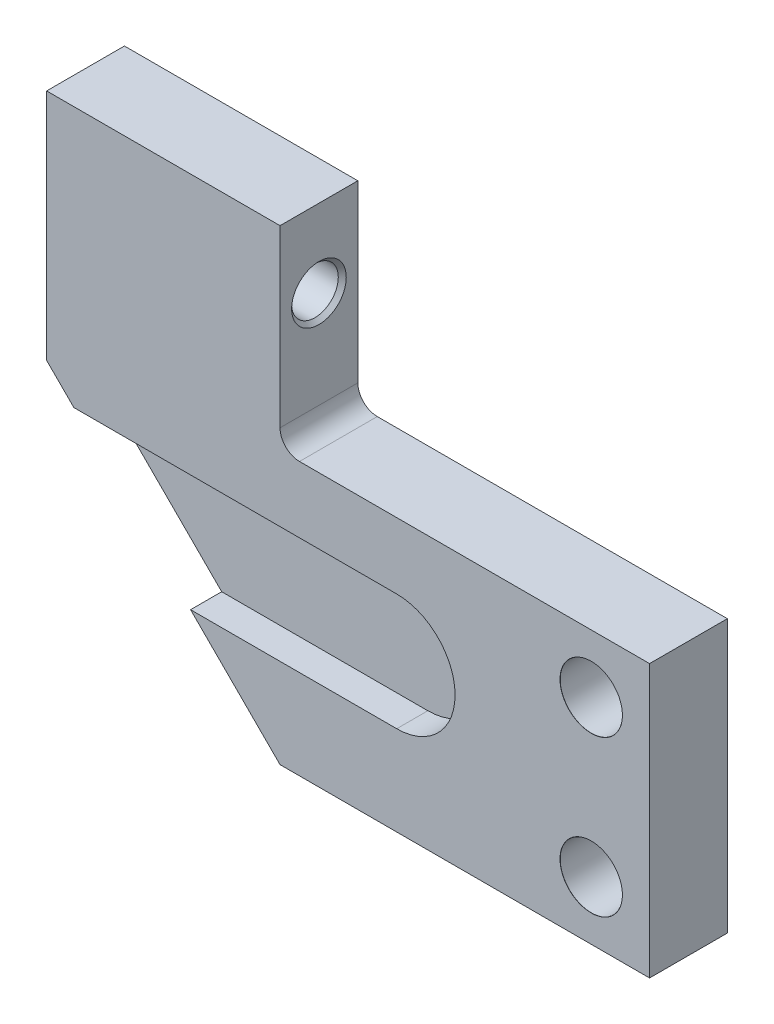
ISO-10303-21;
HEADER;
FILE_DESCRIPTION(('STEP AP214'),'2;1');
FILE_NAME('part.step','',(''),(''),'','','');
FILE_SCHEMA(('AUTOMOTIVE_DESIGN { 1 0 10303 214 1 1 1 1 }'));
ENDSEC;
DATA;
#1=APPLICATION_CONTEXT('core data for automotive mechanical design processes');
#2=APPLICATION_PROTOCOL_DEFINITION('international standard','automotive_design',2000,#1);
#3=PRODUCT_CONTEXT('',#1,'mechanical');
#4=PRODUCT('Part','Part','',(#3));
#5=PRODUCT_RELATED_PRODUCT_CATEGORY('part','',(#4));
#6=PRODUCT_DEFINITION_FORMATION('','',#4);
#7=PRODUCT_DEFINITION_CONTEXT('part definition',#1,'design');
#8=PRODUCT_DEFINITION('design','',#6,#7);
#9=PRODUCT_DEFINITION_SHAPE('','',#8);
#10=(LENGTH_UNIT() NAMED_UNIT(*) SI_UNIT(.MILLI.,.METRE.));
#11=(NAMED_UNIT(*) PLANE_ANGLE_UNIT() SI_UNIT($,.RADIAN.));
#12=(NAMED_UNIT(*) SI_UNIT($,.STERADIAN.) SOLID_ANGLE_UNIT());
#13=UNCERTAINTY_MEASURE_WITH_UNIT(LENGTH_MEASURE(1.E-05),#10,'distance_accuracy_value','');
#14=(GEOMETRIC_REPRESENTATION_CONTEXT(3) GLOBAL_UNCERTAINTY_ASSIGNED_CONTEXT((#13)) GLOBAL_UNIT_ASSIGNED_CONTEXT((#10,
#11,#12)) REPRESENTATION_CONTEXT('',''));
#15=CARTESIAN_POINT('',(0.,0.,0.));
#16=DIRECTION('',(0.,0.,1.));
#17=DIRECTION('',(1.,0.,0.));
#18=AXIS2_PLACEMENT_3D('',#15,#16,#17);
#19=CARTESIAN_POINT('',(77.5,70.,20.));
#20=DIRECTION('',(0.,-1.,0.));
#21=DIRECTION('',(0.,0.,-1.));
#22=AXIS2_PLACEMENT_3D('',#19,#20,#21);
#23=PLANE('',#22);
#24=DIRECTION('',(-1.,0.,0.));
#25=VECTOR('',#24,1.);
#26=CARTESIAN_POINT('',(77.5,70.,0.));
#27=LINE('',#26,#25);
#28=CARTESIAN_POINT('',(155.,70.,0.));
#29=VERTEX_POINT('',#28);
#30=CARTESIAN_POINT('',(65.,70.,0.));
#31=VERTEX_POINT('',#30);
#32=EDGE_CURVE('E148',#29,#31,#27,.T.);
#33=ORIENTED_EDGE('',*,*,#32,.T.);
#34=DIRECTION('',(0.,0.,-1.));
#35=VECTOR('',#34,1.);
#36=CARTESIAN_POINT('',(65.,70.,20.));
#37=LINE('',#36,#35);
#38=CARTESIAN_POINT('',(65.,70.,20.));
#39=VERTEX_POINT('',#38);
#40=EDGE_CURVE('E11',#39,#31,#37,.T.);
#41=ORIENTED_EDGE('',*,*,#40,.F.);
#42=DIRECTION('',(-1.,0.,0.));
#43=VECTOR('',#42,1.);
#44=CARTESIAN_POINT('',(77.5,70.,20.));
#45=LINE('',#44,#43);
#46=CARTESIAN_POINT('',(155.,70.,20.));
#47=VERTEX_POINT('',#46);
#48=EDGE_CURVE('E168',#47,#39,#45,.T.);
#49=ORIENTED_EDGE('',*,*,#48,.F.);
#50=DIRECTION('',(0.,0.,-1.));
#51=VECTOR('',#50,1.);
#52=CARTESIAN_POINT('',(155.,70.,20.));
#53=LINE('',#52,#51);
#54=EDGE_CURVE('E143',#47,#29,#53,.T.);
#55=ORIENTED_EDGE('',*,*,#54,.T.);
#56=EDGE_LOOP('',(#33,#41,#49,#55));
#57=FACE_BOUND('',#56,.T.);
#58=ADVANCED_FACE('F37',(#57),#23,.F.);
#59=CARTESIAN_POINT('',(65.,75.,20.));
#60=DIRECTION('',(0.,0.,-1.));
#61=DIRECTION('',(-1.,0.,0.));
#62=AXIS2_PLACEMENT_3D('',#59,#60,#61);
#63=CYLINDRICAL_SURFACE('',#62,5.);
#64=CARTESIAN_POINT('',(65.,75.,0.));
#65=DIRECTION('',(0.,0.,1.));
#66=DIRECTION('',(1.,0.,0.));
#67=AXIS2_PLACEMENT_3D('',#64,#65,#66);
#68=CIRCLE('',#67,5.);
#69=CARTESIAN_POINT('',(60.,75.,0.));
#70=VERTEX_POINT('',#69);
#71=EDGE_CURVE('E151',#31,#70,#68,.F.);
#72=ORIENTED_EDGE('',*,*,#71,.T.);
#73=DIRECTION('',(0.,0.,-1.));
#74=VECTOR('',#73,1.);
#75=CARTESIAN_POINT('',(60.,75.,20.));
#76=LINE('',#75,#74);
#77=CARTESIAN_POINT('',(60.,75.,20.));
#78=VERTEX_POINT('',#77);
#79=EDGE_CURVE('E44',#78,#70,#76,.T.);
#80=ORIENTED_EDGE('',*,*,#79,.F.);
#81=CARTESIAN_POINT('',(65.,75.,20.));
#82=DIRECTION('',(0.,0.,1.));
#83=DIRECTION('',(1.,0.,0.));
#84=AXIS2_PLACEMENT_3D('',#81,#82,#83);
#85=CIRCLE('',#84,5.);
#86=EDGE_CURVE('E101',#39,#78,#85,.F.);
#87=ORIENTED_EDGE('',*,*,#86,.F.);
#88=ORIENTED_EDGE('',*,*,#40,.T.);
#89=EDGE_LOOP('',(#72,#80,#87,#88));
#90=FACE_BOUND('',#89,.T.);
#91=ADVANCED_FACE('F181',(#90),#63,.F.);
#92=CARTESIAN_POINT('',(60.,-92.6115003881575,20.));
#93=DIRECTION('',(1.,0.,0.));
#94=DIRECTION('',(0.,0.,-1.));
#95=AXIS2_PLACEMENT_3D('',#92,#93,#94);
#96=PLANE('',#95);
#97=CARTESIAN_POINT('',(60.,100.,9.99999999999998));
#98=DIRECTION('',(1.,0.,0.));
#99=DIRECTION('',(0.,0.,-1.));
#100=AXIS2_PLACEMENT_3D('',#97,#98,#99);
#101=CIRCLE('',#100,7.025);
#102=CARTESIAN_POINT('',(60.,100.,2.97499999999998));
#103=VERTEX_POINT('',#102);
#104=EDGE_CURVE('E423',#103,#103,#101,.T.);
#105=ORIENTED_EDGE('',*,*,#104,.F.);
#106=EDGE_LOOP('',(#105));
#107=FACE_BOUND('',#106,.T.);
#108=DIRECTION('',(0.,-1.,0.));
#109=VECTOR('',#108,1.);
#110=CARTESIAN_POINT('',(60.,-92.6115003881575,0.));
#111=LINE('',#110,#109);
#112=CARTESIAN_POINT('',(60.,120.,0.));
#113=VERTEX_POINT('',#112);
#114=EDGE_CURVE('E155',#113,#70,#111,.T.);
#115=ORIENTED_EDGE('',*,*,#114,.F.);
#116=DIRECTION('',(0.,0.,-1.));
#117=VECTOR('',#116,1.);
#118=CARTESIAN_POINT('',(60.,120.,20.));
#119=LINE('',#118,#117);
#120=CARTESIAN_POINT('',(60.,120.,20.));
#121=VERTEX_POINT('',#120);
#122=EDGE_CURVE('E174',#121,#113,#119,.T.);
#123=ORIENTED_EDGE('',*,*,#122,.F.);
#124=DIRECTION('',(0.,-1.,0.));
#125=VECTOR('',#124,1.);
#126=CARTESIAN_POINT('',(60.,-92.6115003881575,20.));
#127=LINE('',#126,#125);
#128=EDGE_CURVE('E180',#121,#78,#127,.T.);
#129=ORIENTED_EDGE('',*,*,#128,.T.);
#130=ORIENTED_EDGE('',*,*,#79,.T.);
#131=EDGE_LOOP('',(#115,#123,#129,#130));
#132=FACE_BOUND('',#131,.T.);
#133=ADVANCED_FACE('F178',(#107,#132),#96,.T.);
#134=CARTESIAN_POINT('',(77.5,120.,20.));
#135=DIRECTION('',(0.,1.,0.));
#136=DIRECTION('',(0.,0.,1.));
#137=AXIS2_PLACEMENT_3D('',#134,#135,#136);
#138=PLANE('',#137);
#139=DIRECTION('',(1.,0.,0.));
#140=VECTOR('',#139,1.);
#141=CARTESIAN_POINT('',(77.5,120.,0.));
#142=LINE('',#141,#140);
#143=CARTESIAN_POINT('',(0.,120.,0.));
#144=VERTEX_POINT('',#143);
#145=EDGE_CURVE('E158',#144,#113,#142,.T.);
#146=ORIENTED_EDGE('',*,*,#145,.F.);
#147=DIRECTION('',(0.,0.,-1.));
#148=VECTOR('',#147,1.);
#149=CARTESIAN_POINT('',(0.,120.,20.));
#150=LINE('',#149,#148);
#151=CARTESIAN_POINT('',(0.,120.,20.));
#152=VERTEX_POINT('',#151);
#153=EDGE_CURVE('E172',#152,#144,#150,.T.);
#154=ORIENTED_EDGE('',*,*,#153,.F.);
#155=DIRECTION('',(1.,0.,0.));
#156=VECTOR('',#155,1.);
#157=CARTESIAN_POINT('',(77.5,120.,20.));
#158=LINE('',#157,#156);
#159=EDGE_CURVE('E192',#152,#121,#158,.T.);
#160=ORIENTED_EDGE('',*,*,#159,.T.);
#161=ORIENTED_EDGE('',*,*,#122,.T.);
#162=EDGE_LOOP('',(#146,#154,#160,#161));
#163=FACE_BOUND('',#162,.T.);
#164=ADVANCED_FACE('F189',(#163),#138,.T.);
#165=CARTESIAN_POINT('',(0.,-92.6115003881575,20.));
#166=DIRECTION('',(-1.,0.,0.));
#167=DIRECTION('',(0.,0.,1.));
#168=AXIS2_PLACEMENT_3D('',#165,#166,#167);
#169=PLANE('',#168);
#170=CARTESIAN_POINT('',(0.,100.,9.99999999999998));
#171=DIRECTION('',(1.,0.,0.));
#172=DIRECTION('',(0.,0.,-1.));
#173=AXIS2_PLACEMENT_3D('',#170,#171,#172);
#174=CIRCLE('',#173,7.02499999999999);
#175=CARTESIAN_POINT('',(0.,100.,2.97499999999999));
#176=VERTEX_POINT('',#175);
#177=EDGE_CURVE('E424',#176,#176,#174,.T.);
#178=ORIENTED_EDGE('',*,*,#177,.T.);
#179=EDGE_LOOP('',(#178));
#180=FACE_BOUND('',#179,.T.);
#181=DIRECTION('',(0.,1.,0.));
#182=VECTOR('',#181,1.);
#183=CARTESIAN_POINT('',(0.,-92.6115003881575,0.));
#184=LINE('',#183,#182);
#185=CARTESIAN_POINT('',(0.,60.,0.));
#186=VERTEX_POINT('',#185);
#187=EDGE_CURVE('E161',#186,#144,#184,.T.);
#188=ORIENTED_EDGE('',*,*,#187,.F.);
#189=DIRECTION('',(0.,0.,-1.));
#190=VECTOR('',#189,1.);
#191=CARTESIAN_POINT('',(0.,60.,20.));
#192=LINE('',#191,#190);
#193=CARTESIAN_POINT('',(0.,60.,20.));
#194=VERTEX_POINT('',#193);
#195=EDGE_CURVE('E138',#194,#186,#192,.T.);
#196=ORIENTED_EDGE('',*,*,#195,.F.);
#197=DIRECTION('',(0.,1.,0.));
#198=VECTOR('',#197,1.);
#199=CARTESIAN_POINT('',(0.,-92.6115003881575,20.));
#200=LINE('',#199,#198);
#201=EDGE_CURVE('E128',#194,#152,#200,.T.);
#202=ORIENTED_EDGE('',*,*,#201,.T.);
#203=ORIENTED_EDGE('',*,*,#153,.T.);
#204=EDGE_LOOP('',(#188,#196,#202,#203));
#205=FACE_BOUND('',#204,.T.);
#206=ADVANCED_FACE('F200',(#180,#205),#169,.T.);
#207=CARTESIAN_POINT('',(115.055750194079,-55.0557501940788,20.));
#208=DIRECTION('',(0.707106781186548,0.707106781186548,0.));
#209=DIRECTION('',(-0.707106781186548,0.707106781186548,0.));
#210=AXIS2_PLACEMENT_3D('',#207,#208,#209);
#211=PLANE('',#210);
#212=DIRECTION('',(0.707106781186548,-0.707106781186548,0.));
#213=VECTOR('',#212,1.);
#214=CARTESIAN_POINT('',(6.99999999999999,53.,12.));
#215=LINE('',#214,#213);
#216=CARTESIAN_POINT('',(6.99999999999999,53.,12.));
#217=VERTEX_POINT('',#216);
#218=CARTESIAN_POINT('',(37.,23.,12.));
#219=VERTEX_POINT('',#218);
#220=EDGE_CURVE('E209',#217,#219,#215,.T.);
#221=ORIENTED_EDGE('',*,*,#220,.F.);
#222=DIRECTION('',(0.,0.,1.));
#223=VECTOR('',#222,1.);
#224=CARTESIAN_POINT('',(6.99999999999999,53.,12.));
#225=LINE('',#224,#223);
#226=CARTESIAN_POINT('',(6.99999999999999,53.,20.));
#227=VERTEX_POINT('',#226);
#228=EDGE_CURVE('E152',#217,#227,#225,.T.);
#229=ORIENTED_EDGE('',*,*,#228,.T.);
#230=DIRECTION('',(0.707106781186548,-0.707106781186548,0.));
#231=VECTOR('',#230,1.);
#232=CARTESIAN_POINT('',(115.055750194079,-55.0557501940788,20.));
#233=LINE('',#232,#231);
#234=EDGE_CURVE('E127',#194,#227,#233,.T.);
#235=ORIENTED_EDGE('',*,*,#234,.F.);
#236=ORIENTED_EDGE('',*,*,#195,.T.);
#237=DIRECTION('',(0.707106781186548,-0.707106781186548,0.));
#238=VECTOR('',#237,1.);
#239=CARTESIAN_POINT('',(115.055750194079,-55.0557501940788,0.));
#240=LINE('',#239,#238);
#241=CARTESIAN_POINT('',(60.,0.,0.));
#242=VERTEX_POINT('',#241);
#243=EDGE_CURVE('E135',#186,#242,#240,.T.);
#244=ORIENTED_EDGE('',*,*,#243,.T.);
#245=DIRECTION('',(0.,0.,-1.));
#246=VECTOR('',#245,1.);
#247=CARTESIAN_POINT('',(60.,0.,20.));
#248=LINE('',#247,#246);
#249=CARTESIAN_POINT('',(60.,0.,20.));
#250=VERTEX_POINT('',#249);
#251=EDGE_CURVE('E131',#250,#242,#248,.T.);
#252=ORIENTED_EDGE('',*,*,#251,.F.);
#253=CARTESIAN_POINT('',(37.,23.,20.));
#254=VERTEX_POINT('',#253);
#255=EDGE_CURVE('E117',#254,#250,#233,.T.);
#256=ORIENTED_EDGE('',*,*,#255,.F.);
#257=DIRECTION('',(0.,0.,1.));
#258=VECTOR('',#257,1.);
#259=CARTESIAN_POINT('',(37.,23.,12.));
#260=LINE('',#259,#258);
#261=EDGE_CURVE('E51',#219,#254,#260,.T.);
#262=ORIENTED_EDGE('',*,*,#261,.F.);
#263=EDGE_LOOP('',(#221,#229,#235,#236,#244,#252,#256,#262));
#264=FACE_BOUND('',#263,.T.);
#265=ADVANCED_FACE('F133',(#264),#211,.F.);
#266=CARTESIAN_POINT('',(77.5,0.,20.));
#267=DIRECTION('',(0.,1.,0.));
#268=DIRECTION('',(0.,0.,1.));
#269=AXIS2_PLACEMENT_3D('',#266,#267,#268);
#270=PLANE('',#269);
#271=DIRECTION('',(1.,0.,0.));
#272=VECTOR('',#271,1.);
#273=CARTESIAN_POINT('',(77.5,0.,0.));
#274=LINE('',#273,#272);
#275=CARTESIAN_POINT('',(155.,0.,0.));
#276=VERTEX_POINT('',#275);
#277=EDGE_CURVE('E165',#242,#276,#274,.T.);
#278=ORIENTED_EDGE('',*,*,#277,.T.);
#279=DIRECTION('',(0.,0.,-1.));
#280=VECTOR('',#279,1.);
#281=CARTESIAN_POINT('',(155.,0.,20.));
#282=LINE('',#281,#280);
#283=CARTESIAN_POINT('',(155.,0.,20.));
#284=VERTEX_POINT('',#283);
#285=EDGE_CURVE('E139',#284,#276,#282,.T.);
#286=ORIENTED_EDGE('',*,*,#285,.F.);
#287=DIRECTION('',(1.,0.,0.));
#288=VECTOR('',#287,1.);
#289=CARTESIAN_POINT('',(77.5,0.,20.));
#290=LINE('',#289,#288);
#291=EDGE_CURVE('E122',#250,#284,#290,.T.);
#292=ORIENTED_EDGE('',*,*,#291,.F.);
#293=ORIENTED_EDGE('',*,*,#251,.T.);
#294=EDGE_LOOP('',(#278,#286,#292,#293));
#295=FACE_BOUND('',#294,.T.);
#296=ADVANCED_FACE('F141',(#295),#270,.F.);
#297=CARTESIAN_POINT('',(155.,-92.6115003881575,20.));
#298=DIRECTION('',(-1.,0.,0.));
#299=DIRECTION('',(0.,0.,1.));
#300=AXIS2_PLACEMENT_3D('',#297,#298,#299);
#301=PLANE('',#300);
#302=DIRECTION('',(0.,1.,0.));
#303=VECTOR('',#302,1.);
#304=CARTESIAN_POINT('',(155.,-92.6115003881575,0.));
#305=LINE('',#304,#303);
#306=EDGE_CURVE('E93',#276,#29,#305,.T.);
#307=ORIENTED_EDGE('',*,*,#306,.T.);
#308=ORIENTED_EDGE('',*,*,#54,.F.);
#309=DIRECTION('',(0.,1.,0.));
#310=VECTOR('',#309,1.);
#311=CARTESIAN_POINT('',(155.,-92.6115003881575,20.));
#312=LINE('',#311,#310);
#313=EDGE_CURVE('E60',#284,#47,#312,.T.);
#314=ORIENTED_EDGE('',*,*,#313,.F.);
#315=ORIENTED_EDGE('',*,*,#285,.T.);
#316=EDGE_LOOP('',(#307,#308,#314,#315));
#317=FACE_BOUND('',#316,.T.);
#318=ADVANCED_FACE('F226',(#317),#301,.F.);
#319=CARTESIAN_POINT('',(77.5,-92.6115003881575,20.));
#320=DIRECTION('',(0.,0.,1.));
#321=DIRECTION('',(1.,0.,0.));
#322=AXIS2_PLACEMENT_3D('',#319,#320,#321);
#323=PLANE('',#322);
#324=CARTESIAN_POINT('',(140.,55.,20.));
#325=DIRECTION('',(0.,0.,1.));
#326=DIRECTION('',(1.,0.,0.));
#327=AXIS2_PLACEMENT_3D('',#324,#325,#326);
#328=CIRCLE('',#327,8.025);
#329=CARTESIAN_POINT('',(148.025,55.,20.));
#330=VERTEX_POINT('',#329);
#331=EDGE_CURVE('E436',#330,#330,#328,.T.);
#332=ORIENTED_EDGE('',*,*,#331,.F.);
#333=EDGE_LOOP('',(#332));
#334=FACE_BOUND('',#333,.T.);
#335=CARTESIAN_POINT('',(140.,15.,20.));
#336=DIRECTION('',(0.,0.,1.));
#337=DIRECTION('',(1.,0.,0.));
#338=AXIS2_PLACEMENT_3D('',#335,#336,#337);
#339=CIRCLE('',#338,8.025);
#340=CARTESIAN_POINT('',(148.025,15.,20.));
#341=VERTEX_POINT('',#340);
#342=EDGE_CURVE('E448',#341,#341,#339,.T.);
#343=ORIENTED_EDGE('',*,*,#342,.F.);
#344=EDGE_LOOP('',(#343));
#345=FACE_BOUND('',#344,.T.);
#346=DIRECTION('',(-1.,0.,0.));
#347=VECTOR('',#346,1.);
#348=CARTESIAN_POINT('',(6.99999999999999,53.,20.));
#349=LINE('',#348,#347);
#350=CARTESIAN_POINT('',(90.,53.,20.));
#351=VERTEX_POINT('',#350);
#352=EDGE_CURVE('E204',#351,#227,#349,.T.);
#353=ORIENTED_EDGE('',*,*,#352,.F.);
#354=CARTESIAN_POINT('',(90.,38.,20.));
#355=DIRECTION('',(0.,0.,1.));
#356=DIRECTION('',(-1.,0.,0.));
#357=AXIS2_PLACEMENT_3D('',#354,#355,#356);
#358=CIRCLE('',#357,15.);
#359=CARTESIAN_POINT('',(90.,23.,20.));
#360=VERTEX_POINT('',#359);
#361=EDGE_CURVE('E465',#360,#351,#358,.T.);
#362=ORIENTED_EDGE('',*,*,#361,.F.);
#363=DIRECTION('',(1.,0.,0.));
#364=VECTOR('',#363,1.);
#365=CARTESIAN_POINT('',(90.,23.,20.));
#366=LINE('',#365,#364);
#367=EDGE_CURVE('E125',#254,#360,#366,.T.);
#368=ORIENTED_EDGE('',*,*,#367,.F.);
#369=ORIENTED_EDGE('',*,*,#255,.T.);
#370=ORIENTED_EDGE('',*,*,#291,.T.);
#371=ORIENTED_EDGE('',*,*,#313,.T.);
#372=ORIENTED_EDGE('',*,*,#48,.T.);
#373=ORIENTED_EDGE('',*,*,#86,.T.);
#374=ORIENTED_EDGE('',*,*,#128,.F.);
#375=ORIENTED_EDGE('',*,*,#159,.F.);
#376=ORIENTED_EDGE('',*,*,#201,.F.);
#377=ORIENTED_EDGE('',*,*,#234,.T.);
#378=EDGE_LOOP('',(#353,#362,#368,#369,#370,#371,#372,#373,#374,#375,#376,#377));
#379=FACE_BOUND('',#378,.T.);
#380=ADVANCED_FACE('F120',(#334,#345,#379),#323,.T.);
#381=CARTESIAN_POINT('',(77.5,-92.6115003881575,0.));
#382=DIRECTION('',(0.,0.,1.));
#383=DIRECTION('',(1.,0.,0.));
#384=AXIS2_PLACEMENT_3D('',#381,#382,#383);
#385=PLANE('',#384);
#386=CARTESIAN_POINT('',(140.,55.,0.));
#387=DIRECTION('',(0.,0.,1.));
#388=DIRECTION('',(1.,0.,0.));
#389=AXIS2_PLACEMENT_3D('',#386,#387,#388);
#390=CIRCLE('',#389,8.025);
#391=CARTESIAN_POINT('',(148.025,55.,0.));
#392=VERTEX_POINT('',#391);
#393=EDGE_CURVE('E433',#392,#392,#390,.T.);
#394=ORIENTED_EDGE('',*,*,#393,.T.);
#395=EDGE_LOOP('',(#394));
#396=FACE_BOUND('',#395,.T.);
#397=CARTESIAN_POINT('',(140.,15.,0.));
#398=DIRECTION('',(0.,0.,1.));
#399=DIRECTION('',(1.,0.,0.));
#400=AXIS2_PLACEMENT_3D('',#397,#398,#399);
#401=CIRCLE('',#400,8.025);
#402=CARTESIAN_POINT('',(148.025,15.,0.));
#403=VERTEX_POINT('',#402);
#404=EDGE_CURVE('E445',#403,#403,#401,.T.);
#405=ORIENTED_EDGE('',*,*,#404,.T.);
#406=EDGE_LOOP('',(#405));
#407=FACE_BOUND('',#406,.T.);
#408=ORIENTED_EDGE('',*,*,#32,.F.);
#409=ORIENTED_EDGE('',*,*,#306,.F.);
#410=ORIENTED_EDGE('',*,*,#277,.F.);
#411=ORIENTED_EDGE('',*,*,#243,.F.);
#412=ORIENTED_EDGE('',*,*,#187,.T.);
#413=ORIENTED_EDGE('',*,*,#145,.T.);
#414=ORIENTED_EDGE('',*,*,#114,.T.);
#415=ORIENTED_EDGE('',*,*,#71,.F.);
#416=EDGE_LOOP('',(#408,#409,#410,#411,#412,#413,#414,#415));
#417=FACE_BOUND('',#416,.T.);
#418=ADVANCED_FACE('F185',(#396,#407,#417),#385,.F.);
#419=CARTESIAN_POINT('',(6.99999999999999,53.,12.));
#420=DIRECTION('',(0.,1.,0.));
#421=DIRECTION('',(-1.,0.,0.));
#422=AXIS2_PLACEMENT_3D('',#419,#420,#421);
#423=PLANE('',#422);
#424=ORIENTED_EDGE('',*,*,#352,.T.);
#425=ORIENTED_EDGE('',*,*,#228,.F.);
#426=DIRECTION('',(-1.,0.,0.));
#427=VECTOR('',#426,1.);
#428=CARTESIAN_POINT('',(6.99999999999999,53.,12.));
#429=LINE('',#428,#427);
#430=CARTESIAN_POINT('',(90.,53.,12.));
#431=VERTEX_POINT('',#430);
#432=EDGE_CURVE('E223',#431,#217,#429,.T.);
#433=ORIENTED_EDGE('',*,*,#432,.F.);
#434=DIRECTION('',(0.,0.,1.));
#435=VECTOR('',#434,1.);
#436=CARTESIAN_POINT('',(90.,53.,12.));
#437=LINE('',#436,#435);
#438=EDGE_CURVE('E213',#431,#351,#437,.T.);
#439=ORIENTED_EDGE('',*,*,#438,.T.);
#440=EDGE_LOOP('',(#424,#425,#433,#439));
#441=FACE_BOUND('',#440,.T.);
#442=ADVANCED_FACE('F285',(#441),#423,.F.);
#443=CARTESIAN_POINT('',(90.,38.,12.));
#444=DIRECTION('',(0.,0.,1.));
#445=DIRECTION('',(1.,0.,0.));
#446=AXIS2_PLACEMENT_3D('',#443,#444,#445);
#447=CYLINDRICAL_SURFACE('',#446,15.);
#448=ORIENTED_EDGE('',*,*,#361,.T.);
#449=ORIENTED_EDGE('',*,*,#438,.F.);
#450=CARTESIAN_POINT('',(90.,38.,12.));
#451=DIRECTION('',(0.,0.,1.));
#452=DIRECTION('',(-1.,0.,0.));
#453=AXIS2_PLACEMENT_3D('',#450,#451,#452);
#454=CIRCLE('',#453,15.);
#455=CARTESIAN_POINT('',(90.,23.,12.));
#456=VERTEX_POINT('',#455);
#457=EDGE_CURVE('E461',#456,#431,#454,.T.);
#458=ORIENTED_EDGE('',*,*,#457,.F.);
#459=DIRECTION('',(0.,0.,1.));
#460=VECTOR('',#459,1.);
#461=CARTESIAN_POINT('',(90.,23.,12.));
#462=LINE('',#461,#460);
#463=EDGE_CURVE('E216',#456,#360,#462,.T.);
#464=ORIENTED_EDGE('',*,*,#463,.T.);
#465=EDGE_LOOP('',(#448,#449,#458,#464));
#466=FACE_BOUND('',#465,.T.);
#467=ADVANCED_FACE('F293',(#466),#447,.F.);
#468=CARTESIAN_POINT('',(90.,23.,12.));
#469=DIRECTION('',(0.,-1.,0.));
#470=DIRECTION('',(1.,0.,0.));
#471=AXIS2_PLACEMENT_3D('',#468,#469,#470);
#472=PLANE('',#471);
#473=ORIENTED_EDGE('',*,*,#367,.T.);
#474=ORIENTED_EDGE('',*,*,#463,.F.);
#475=DIRECTION('',(1.,0.,0.));
#476=VECTOR('',#475,1.);
#477=CARTESIAN_POINT('',(90.,23.,12.));
#478=LINE('',#477,#476);
#479=EDGE_CURVE('E458',#219,#456,#478,.T.);
#480=ORIENTED_EDGE('',*,*,#479,.F.);
#481=ORIENTED_EDGE('',*,*,#261,.T.);
#482=EDGE_LOOP('',(#473,#474,#480,#481));
#483=FACE_BOUND('',#482,.T.);
#484=ADVANCED_FACE('F301',(#483),#472,.F.);
#485=CARTESIAN_POINT('',(90.,38.,12.));
#486=DIRECTION('',(0.,0.,-1.));
#487=DIRECTION('',(-1.,0.,0.));
#488=AXIS2_PLACEMENT_3D('',#485,#486,#487);
#489=PLANE('',#488);
#490=ORIENTED_EDGE('',*,*,#220,.T.);
#491=ORIENTED_EDGE('',*,*,#479,.T.);
#492=ORIENTED_EDGE('',*,*,#457,.T.);
#493=ORIENTED_EDGE('',*,*,#432,.T.);
#494=EDGE_LOOP('',(#490,#491,#492,#493));
#495=FACE_BOUND('',#494,.T.);
#496=ADVANCED_FACE('F310',(#495),#489,.F.);
#497=CARTESIAN_POINT('',(140.,15.,0.0249999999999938));
#498=DIRECTION('',(0.,0.,-1.));
#499=DIRECTION('',(-1.,0.,0.));
#500=AXIS2_PLACEMENT_3D('',#497,#498,#499);
#501=CONICAL_SURFACE('',#500,8.00000000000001,0.785398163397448);
#502=ORIENTED_EDGE('',*,*,#404,.F.);
#503=EDGE_LOOP('',(#502));
#504=FACE_BOUND('',#503,.T.);
#505=CARTESIAN_POINT('',(140.,15.,0.0249999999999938));
#506=DIRECTION('',(0.,0.,1.));
#507=DIRECTION('',(1.,0.,0.));
#508=AXIS2_PLACEMENT_3D('',#505,#506,#507);
#509=CIRCLE('',#508,8.00000000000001);
#510=CARTESIAN_POINT('',(148.,15.,0.0249999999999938));
#511=VERTEX_POINT('',#510);
#512=EDGE_CURVE('E454',#511,#511,#509,.T.);
#513=ORIENTED_EDGE('',*,*,#512,.T.);
#514=EDGE_LOOP('',(#513));
#515=FACE_BOUND('',#514,.T.);
#516=ADVANCED_FACE('F317',(#504,#515),#501,.F.);
#517=CARTESIAN_POINT('',(140.,15.,20.));
#518=DIRECTION('',(0.,0.,1.));
#519=DIRECTION('',(1.,0.,0.));
#520=AXIS2_PLACEMENT_3D('',#517,#518,#519);
#521=CYLINDRICAL_SURFACE('',#520,7.99999999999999);
#522=ORIENTED_EDGE('',*,*,#512,.F.);
#523=EDGE_LOOP('',(#522));
#524=FACE_BOUND('',#523,.T.);
#525=CARTESIAN_POINT('',(140.,15.,19.975));
#526=DIRECTION('',(0.,0.,1.));
#527=DIRECTION('',(1.,0.,0.));
#528=AXIS2_PLACEMENT_3D('',#525,#526,#527);
#529=CIRCLE('',#528,7.99999999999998);
#530=CARTESIAN_POINT('',(148.,15.,19.975));
#531=VERTEX_POINT('',#530);
#532=EDGE_CURVE('E451',#531,#531,#529,.T.);
#533=ORIENTED_EDGE('',*,*,#532,.T.);
#534=EDGE_LOOP('',(#533));
#535=FACE_BOUND('',#534,.T.);
#536=ADVANCED_FACE('F325',(#524,#535),#521,.F.);
#537=CARTESIAN_POINT('',(140.,15.,20.));
#538=DIRECTION('',(0.,0.,1.));
#539=DIRECTION('',(1.,0.,0.));
#540=AXIS2_PLACEMENT_3D('',#537,#538,#539);
#541=CONICAL_SURFACE('',#540,8.025,0.785398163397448);
#542=ORIENTED_EDGE('',*,*,#532,.F.);
#543=EDGE_LOOP('',(#542));
#544=FACE_BOUND('',#543,.T.);
#545=ORIENTED_EDGE('',*,*,#342,.T.);
#546=EDGE_LOOP('',(#545));
#547=FACE_BOUND('',#546,.T.);
#548=ADVANCED_FACE('F334',(#544,#547),#541,.F.);
#549=CARTESIAN_POINT('',(140.,55.,0.0249999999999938));
#550=DIRECTION('',(0.,0.,-1.));
#551=DIRECTION('',(-1.,0.,0.));
#552=AXIS2_PLACEMENT_3D('',#549,#550,#551);
#553=CONICAL_SURFACE('',#552,8.00000000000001,0.785398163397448);
#554=ORIENTED_EDGE('',*,*,#393,.F.);
#555=EDGE_LOOP('',(#554));
#556=FACE_BOUND('',#555,.T.);
#557=CARTESIAN_POINT('',(140.,55.,0.0249999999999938));
#558=DIRECTION('',(0.,0.,1.));
#559=DIRECTION('',(1.,0.,0.));
#560=AXIS2_PLACEMENT_3D('',#557,#558,#559);
#561=CIRCLE('',#560,8.00000000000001);
#562=CARTESIAN_POINT('',(148.,55.,0.0249999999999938));
#563=VERTEX_POINT('',#562);
#564=EDGE_CURVE('E442',#563,#563,#561,.T.);
#565=ORIENTED_EDGE('',*,*,#564,.T.);
#566=EDGE_LOOP('',(#565));
#567=FACE_BOUND('',#566,.T.);
#568=ADVANCED_FACE('F343',(#556,#567),#553,.F.);
#569=CARTESIAN_POINT('',(140.,55.,20.));
#570=DIRECTION('',(0.,0.,1.));
#571=DIRECTION('',(1.,0.,0.));
#572=AXIS2_PLACEMENT_3D('',#569,#570,#571);
#573=CYLINDRICAL_SURFACE('',#572,7.99999999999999);
#574=ORIENTED_EDGE('',*,*,#564,.F.);
#575=EDGE_LOOP('',(#574));
#576=FACE_BOUND('',#575,.T.);
#577=CARTESIAN_POINT('',(140.,55.,19.975));
#578=DIRECTION('',(0.,0.,1.));
#579=DIRECTION('',(1.,0.,0.));
#580=AXIS2_PLACEMENT_3D('',#577,#578,#579);
#581=CIRCLE('',#580,7.99999999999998);
#582=CARTESIAN_POINT('',(148.,55.,19.975));
#583=VERTEX_POINT('',#582);
#584=EDGE_CURVE('E439',#583,#583,#581,.T.);
#585=ORIENTED_EDGE('',*,*,#584,.T.);
#586=EDGE_LOOP('',(#585));
#587=FACE_BOUND('',#586,.T.);
#588=ADVANCED_FACE('F352',(#576,#587),#573,.F.);
#589=CARTESIAN_POINT('',(140.,55.,20.));
#590=DIRECTION('',(0.,0.,1.));
#591=DIRECTION('',(1.,0.,0.));
#592=AXIS2_PLACEMENT_3D('',#589,#590,#591);
#593=CONICAL_SURFACE('',#592,8.025,0.785398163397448);
#594=ORIENTED_EDGE('',*,*,#584,.F.);
#595=EDGE_LOOP('',(#594));
#596=FACE_BOUND('',#595,.T.);
#597=ORIENTED_EDGE('',*,*,#331,.T.);
#598=EDGE_LOOP('',(#597));
#599=FACE_BOUND('',#598,.T.);
#600=ADVANCED_FACE('F361',(#596,#599),#593,.F.);
#601=CARTESIAN_POINT('',(1.02499999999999,100.,9.99999999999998));
#602=DIRECTION('',(-1.,0.,0.));
#603=DIRECTION('',(0.,0.,1.));
#604=AXIS2_PLACEMENT_3D('',#601,#602,#603);
#605=CONICAL_SURFACE('',#604,5.99999999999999,0.785398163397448);
#606=ORIENTED_EDGE('',*,*,#177,.F.);
#607=EDGE_LOOP('',(#606));
#608=FACE_BOUND('',#607,.T.);
#609=CARTESIAN_POINT('',(1.02499999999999,100.,9.99999999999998));
#610=DIRECTION('',(1.,0.,0.));
#611=DIRECTION('',(0.,0.,-1.));
#612=AXIS2_PLACEMENT_3D('',#609,#610,#611);
#613=CIRCLE('',#612,5.99999999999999);
#614=CARTESIAN_POINT('',(1.02499999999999,100.,3.99999999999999));
#615=VERTEX_POINT('',#614);
#616=EDGE_CURVE('E426',#615,#615,#613,.T.);
#617=ORIENTED_EDGE('',*,*,#616,.T.);
#618=EDGE_LOOP('',(#617));
#619=FACE_BOUND('',#618,.T.);
#620=ADVANCED_FACE('F370',(#608,#619),#605,.F.);
#621=CARTESIAN_POINT('',(60.,100.,9.99999999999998));
#622=DIRECTION('',(1.,0.,0.));
#623=DIRECTION('',(0.,0.,-1.));
#624=AXIS2_PLACEMENT_3D('',#621,#622,#623);
#625=CYLINDRICAL_SURFACE('',#624,5.99999999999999);
#626=ORIENTED_EDGE('',*,*,#616,.F.);
#627=EDGE_LOOP('',(#626));
#628=FACE_BOUND('',#627,.T.);
#629=CARTESIAN_POINT('',(58.975,100.,9.99999999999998));
#630=DIRECTION('',(1.,0.,0.));
#631=DIRECTION('',(0.,0.,-1.));
#632=AXIS2_PLACEMENT_3D('',#629,#630,#631);
#633=CIRCLE('',#632,5.99999999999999);
#634=CARTESIAN_POINT('',(58.975,100.,3.99999999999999));
#635=VERTEX_POINT('',#634);
#636=EDGE_CURVE('E420',#635,#635,#633,.T.);
#637=ORIENTED_EDGE('',*,*,#636,.T.);
#638=EDGE_LOOP('',(#637));
#639=FACE_BOUND('',#638,.T.);
#640=ADVANCED_FACE('F380',(#628,#639),#625,.F.);
#641=CARTESIAN_POINT('',(60.,100.,9.99999999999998));
#642=DIRECTION('',(1.,0.,0.));
#643=DIRECTION('',(0.,0.,-1.));
#644=AXIS2_PLACEMENT_3D('',#641,#642,#643);
#645=CONICAL_SURFACE('',#644,7.025,0.785398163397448);
#646=ORIENTED_EDGE('',*,*,#636,.F.);
#647=EDGE_LOOP('',(#646));
#648=FACE_BOUND('',#647,.T.);
#649=ORIENTED_EDGE('',*,*,#104,.T.);
#650=EDGE_LOOP('',(#649));
#651=FACE_BOUND('',#650,.T.);
#652=ADVANCED_FACE('F389',(#648,#651),#645,.F.);
#653=CLOSED_SHELL('',(#58,#91,#133,#164,#206,#265,#296,#318,#380,#418,#442,#467,#484,#496,#516,
#536,#548,#568,#588,#600,#620,#640,#652));
#654=MANIFOLD_SOLID_BREP('B2',#653);
#655=ADVANCED_BREP_SHAPE_REPRESENTATION('',(#18,#654),#14);
#656=SHAPE_DEFINITION_REPRESENTATION(#9,#655);
ENDSEC;
END-ISO-10303-21;
